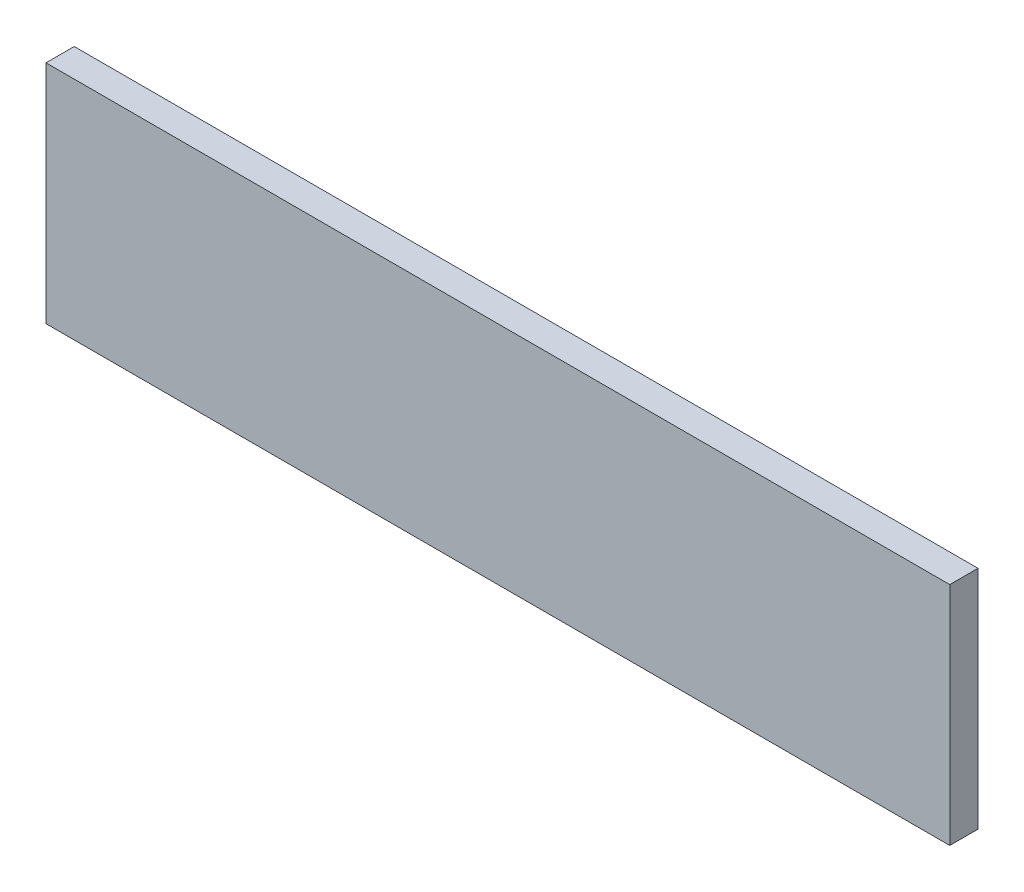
ISO-10303-21;
HEADER;
FILE_DESCRIPTION(('STEP AP214'),'2;1');
FILE_NAME('part.step','',(''),(''),'','','');
FILE_SCHEMA(('AUTOMOTIVE_DESIGN { 1 0 10303 214 1 1 1 1 }'));
ENDSEC;
DATA;
#1=APPLICATION_CONTEXT('core data for automotive mechanical design processes');
#2=APPLICATION_PROTOCOL_DEFINITION('international standard','automotive_design',2000,#1);
#3=PRODUCT_CONTEXT('',#1,'mechanical');
#4=PRODUCT('Part','Part','',(#3));
#5=PRODUCT_RELATED_PRODUCT_CATEGORY('part','',(#4));
#6=PRODUCT_DEFINITION_FORMATION('','',#4);
#7=PRODUCT_DEFINITION_CONTEXT('part definition',#1,'design');
#8=PRODUCT_DEFINITION('design','',#6,#7);
#9=PRODUCT_DEFINITION_SHAPE('','',#8);
#10=(LENGTH_UNIT() NAMED_UNIT(*) SI_UNIT(.MILLI.,.METRE.));
#11=(NAMED_UNIT(*) PLANE_ANGLE_UNIT() SI_UNIT($,.RADIAN.));
#12=(NAMED_UNIT(*) SI_UNIT($,.STERADIAN.) SOLID_ANGLE_UNIT());
#13=UNCERTAINTY_MEASURE_WITH_UNIT(LENGTH_MEASURE(1.E-05),#10,'distance_accuracy_value','');
#14=(GEOMETRIC_REPRESENTATION_CONTEXT(3) GLOBAL_UNCERTAINTY_ASSIGNED_CONTEXT((#13)) GLOBAL_UNIT_ASSIGNED_CONTEXT((#10,
#11,#12)) REPRESENTATION_CONTEXT('',''));
#15=CARTESIAN_POINT('',(0.,0.,0.));
#16=DIRECTION('',(0.,0.,1.));
#17=DIRECTION('',(1.,0.,0.));
#18=AXIS2_PLACEMENT_3D('',#15,#16,#17);
#19=CARTESIAN_POINT('',(25.4,-6.35,1.5875));
#20=DIRECTION('',(-1.,0.,0.));
#21=DIRECTION('',(0.,0.,1.));
#22=AXIS2_PLACEMENT_3D('',#19,#20,#21);
#23=PLANE('',#22);
#24=DIRECTION('',(0.,1.,0.));
#25=VECTOR('',#24,1.);
#26=CARTESIAN_POINT('',(25.4,-6.35,0.));
#27=LINE('',#26,#25);
#28=CARTESIAN_POINT('',(25.4,-6.35,0.));
#29=VERTEX_POINT('',#28);
#30=CARTESIAN_POINT('',(25.4,6.35,0.));
#31=VERTEX_POINT('',#30);
#32=EDGE_CURVE('E97',#29,#31,#27,.T.);
#33=ORIENTED_EDGE('',*,*,#32,.T.);
#34=DIRECTION('',(0.,0.,-1.));
#35=VECTOR('',#34,1.);
#36=CARTESIAN_POINT('',(25.4,6.35,1.5875));
#37=LINE('',#36,#35);
#38=CARTESIAN_POINT('',(25.4,6.35,1.5875));
#39=VERTEX_POINT('',#38);
#40=EDGE_CURVE('E11',#39,#31,#37,.T.);
#41=ORIENTED_EDGE('',*,*,#40,.F.);
#42=DIRECTION('',(0.,1.,0.));
#43=VECTOR('',#42,1.);
#44=CARTESIAN_POINT('',(25.4,-6.35,1.5875));
#45=LINE('',#44,#43);
#46=CARTESIAN_POINT('',(25.4,-6.35,1.5875));
#47=VERTEX_POINT('',#46);
#48=EDGE_CURVE('E85',#47,#39,#45,.T.);
#49=ORIENTED_EDGE('',*,*,#48,.F.);
#50=DIRECTION('',(0.,0.,-1.));
#51=VECTOR('',#50,1.);
#52=CARTESIAN_POINT('',(25.4,-6.35,1.5875));
#53=LINE('',#52,#51);
#54=EDGE_CURVE('E93',#47,#29,#53,.T.);
#55=ORIENTED_EDGE('',*,*,#54,.T.);
#56=EDGE_LOOP('',(#33,#41,#49,#55));
#57=FACE_BOUND('',#56,.T.);
#58=ADVANCED_FACE('F34',(#57),#23,.F.);
#59=CARTESIAN_POINT('',(-25.4,6.35,1.5875));
#60=DIRECTION('',(0.,-1.,0.));
#61=DIRECTION('',(0.,0.,-1.));
#62=AXIS2_PLACEMENT_3D('',#59,#60,#61);
#63=PLANE('',#62);
#64=DIRECTION('',(-1.,0.,0.));
#65=VECTOR('',#64,1.);
#66=CARTESIAN_POINT('',(-25.4,6.35,0.));
#67=LINE('',#66,#65);
#68=CARTESIAN_POINT('',(-25.4,6.35,0.));
#69=VERTEX_POINT('',#68);
#70=EDGE_CURVE('E89',#31,#69,#67,.T.);
#71=ORIENTED_EDGE('',*,*,#70,.T.);
#72=DIRECTION('',(0.,0.,-1.));
#73=VECTOR('',#72,1.);
#74=CARTESIAN_POINT('',(-25.4,6.35,1.5875));
#75=LINE('',#74,#73);
#76=CARTESIAN_POINT('',(-25.4,6.35,1.5875));
#77=VERTEX_POINT('',#76);
#78=EDGE_CURVE('E42',#77,#69,#75,.T.);
#79=ORIENTED_EDGE('',*,*,#78,.F.);
#80=DIRECTION('',(-1.,0.,0.));
#81=VECTOR('',#80,1.);
#82=CARTESIAN_POINT('',(-25.4,6.35,1.5875));
#83=LINE('',#82,#81);
#84=EDGE_CURVE('E80',#39,#77,#83,.T.);
#85=ORIENTED_EDGE('',*,*,#84,.F.);
#86=ORIENTED_EDGE('',*,*,#40,.T.);
#87=EDGE_LOOP('',(#71,#79,#85,#86));
#88=FACE_BOUND('',#87,.T.);
#89=ADVANCED_FACE('F88',(#88),#63,.F.);
#90=CARTESIAN_POINT('',(-25.4,-6.35,1.5875));
#91=DIRECTION('',(1.,0.,0.));
#92=DIRECTION('',(0.,0.,-1.));
#93=AXIS2_PLACEMENT_3D('',#90,#91,#92);
#94=PLANE('',#93);
#95=DIRECTION('',(0.,-1.,0.));
#96=VECTOR('',#95,1.);
#97=CARTESIAN_POINT('',(-25.4,-6.35,0.));
#98=LINE('',#97,#96);
#99=CARTESIAN_POINT('',(-25.4,-6.35,0.));
#100=VERTEX_POINT('',#99);
#101=EDGE_CURVE('E67',#69,#100,#98,.T.);
#102=ORIENTED_EDGE('',*,*,#101,.T.);
#103=DIRECTION('',(0.,0.,-1.));
#104=VECTOR('',#103,1.);
#105=CARTESIAN_POINT('',(-25.4,-6.35,1.5875));
#106=LINE('',#105,#104);
#107=CARTESIAN_POINT('',(-25.4,-6.35,1.5875));
#108=VERTEX_POINT('',#107);
#109=EDGE_CURVE('E90',#108,#100,#106,.T.);
#110=ORIENTED_EDGE('',*,*,#109,.F.);
#111=DIRECTION('',(0.,-1.,0.));
#112=VECTOR('',#111,1.);
#113=CARTESIAN_POINT('',(-25.4,-6.35,1.5875));
#114=LINE('',#113,#112);
#115=EDGE_CURVE('E83',#77,#108,#114,.T.);
#116=ORIENTED_EDGE('',*,*,#115,.F.);
#117=ORIENTED_EDGE('',*,*,#78,.T.);
#118=EDGE_LOOP('',(#102,#110,#116,#117));
#119=FACE_BOUND('',#118,.T.);
#120=ADVANCED_FACE('F91',(#119),#94,.F.);
#121=CARTESIAN_POINT('',(-25.4,-6.35,1.5875));
#122=DIRECTION('',(0.,1.,0.));
#123=DIRECTION('',(0.,0.,1.));
#124=AXIS2_PLACEMENT_3D('',#121,#122,#123);
#125=PLANE('',#124);
#126=DIRECTION('',(1.,0.,0.));
#127=VECTOR('',#126,1.);
#128=CARTESIAN_POINT('',(-25.4,-6.35,0.));
#129=LINE('',#128,#127);
#130=EDGE_CURVE('E73',#100,#29,#129,.T.);
#131=ORIENTED_EDGE('',*,*,#130,.T.);
#132=ORIENTED_EDGE('',*,*,#54,.F.);
#133=DIRECTION('',(1.,0.,0.));
#134=VECTOR('',#133,1.);
#135=CARTESIAN_POINT('',(-25.4,-6.35,1.5875));
#136=LINE('',#135,#134);
#137=EDGE_CURVE('E50',#108,#47,#136,.T.);
#138=ORIENTED_EDGE('',*,*,#137,.F.);
#139=ORIENTED_EDGE('',*,*,#109,.T.);
#140=EDGE_LOOP('',(#131,#132,#138,#139));
#141=FACE_BOUND('',#140,.T.);
#142=ADVANCED_FACE('F104',(#141),#125,.F.);
#143=CARTESIAN_POINT('',(0.,0.,1.5875));
#144=DIRECTION('',(0.,0.,-1.));
#145=DIRECTION('',(-1.,0.,0.));
#146=AXIS2_PLACEMENT_3D('',#143,#144,#145);
#147=PLANE('',#146);
#148=ORIENTED_EDGE('',*,*,#48,.T.);
#149=ORIENTED_EDGE('',*,*,#84,.T.);
#150=ORIENTED_EDGE('',*,*,#115,.T.);
#151=ORIENTED_EDGE('',*,*,#137,.T.);
#152=EDGE_LOOP('',(#148,#149,#150,#151));
#153=FACE_BOUND('',#152,.T.);
#154=ADVANCED_FACE('F81',(#153),#147,.F.);
#155=CARTESIAN_POINT('',(0.,0.,0.));
#156=DIRECTION('',(0.,0.,-1.));
#157=DIRECTION('',(-1.,0.,0.));
#158=AXIS2_PLACEMENT_3D('',#155,#156,#157);
#159=PLANE('',#158);
#160=ORIENTED_EDGE('',*,*,#32,.F.);
#161=ORIENTED_EDGE('',*,*,#130,.F.);
#162=ORIENTED_EDGE('',*,*,#101,.F.);
#163=ORIENTED_EDGE('',*,*,#70,.F.);
#164=EDGE_LOOP('',(#160,#161,#162,#163));
#165=FACE_BOUND('',#164,.T.);
#166=ADVANCED_FACE('F107',(#165),#159,.T.);
#167=CLOSED_SHELL('',(#58,#89,#120,#142,#154,#166));
#168=MANIFOLD_SOLID_BREP('B2',#167);
#169=ADVANCED_BREP_SHAPE_REPRESENTATION('',(#18,#168),#14);
#170=SHAPE_DEFINITION_REPRESENTATION(#9,#169);
ENDSEC;
END-ISO-10303-21;
